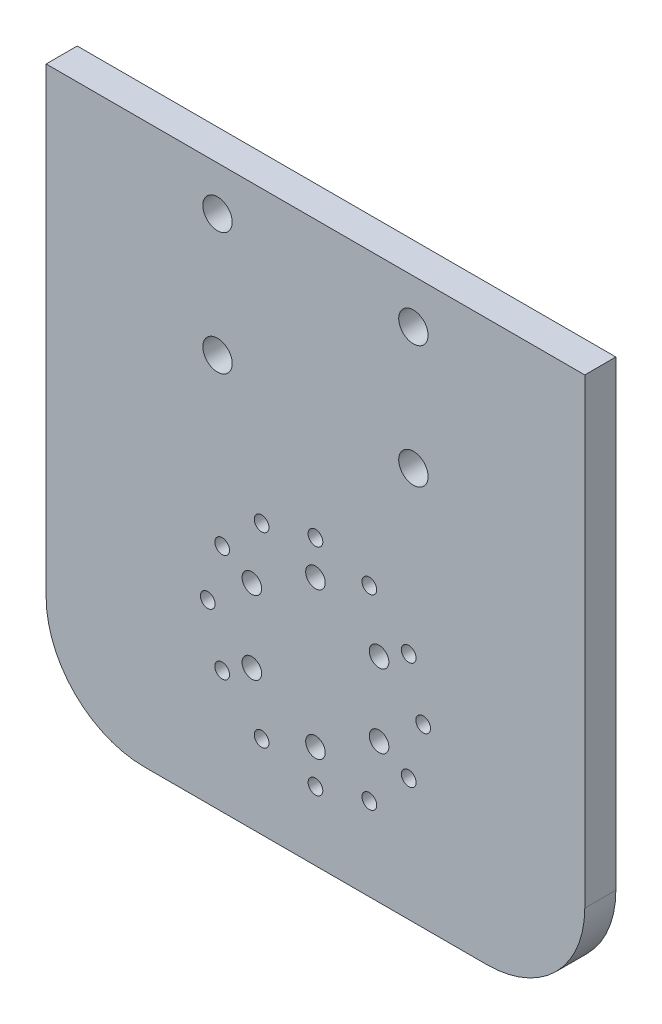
from build123d import *

# Parameters (mm, degrees)
SKETCH1_W           = 114.3
SKETCH1_H           = 110
SKETCH1_R           = 2
SKETCH1_R_2         = 1.5
SKETCH1_R_3         = 3
BOSS_EXTRUDE1_DEPTH = 6.35
FILLET1_R           = 20


with BuildPart() as part:
    # Sketch1 → Boss-Extrude1 (new body)
    with BuildSketch(Plane(origin=(0, 0, 0), x_dir=(0, 1, 0), z_dir=(0, 0, 1))):
        with Locations((21.15, 0)):
            Rectangle(SKETCH1_W, SKETCH1_H)
        with Locations(Location((15, 0, 0), (0, 0, 270))):
            Circle(SKETCH1_R, mode=Mode.SUBTRACT)
        with Locations(Location((7.5, -12.990381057, 0), (0, 0, 270))):
            Circle(SKETCH1_R, mode=Mode.SUBTRACT)
        with Locations(Location((-7.5, -12.990381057, 0), (0, 0, 270))):
            Circle(SKETCH1_R, mode=Mode.SUBTRACT)
        with Locations(Location((-15, 0, 0), (0, 0, 270))):
            Circle(SKETCH1_R, mode=Mode.SUBTRACT)
        with Locations(Location((-7.5, 12.990381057, 0), (0, 0, 270))):
            Circle(SKETCH1_R, mode=Mode.SUBTRACT)
        with Locations(Location((7.5, 12.990381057, 0), (0, 0, 270))):
            Circle(SKETCH1_R, mode=Mode.SUBTRACT)
        with Locations(Location((22, 0, 0), (0, 0, 270))):
            Circle(SKETCH1_R_2, mode=Mode.SUBTRACT)
        with Locations(Location((19.052558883, -11, 0), (0, 0, 270))):
            Circle(SKETCH1_R_2, mode=Mode.SUBTRACT)
        with Locations(Location((11, -19.052558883, 0), (0, 0, 270))):
            Circle(SKETCH1_R_2, mode=Mode.SUBTRACT)
        with Locations(Location((0, -22, 0), (0, 0, 270))):
            Circle(SKETCH1_R_2, mode=Mode.SUBTRACT)
        with Locations(Location((-11, -19.052558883, 0), (0, 0, 270))):
            Circle(SKETCH1_R_2, mode=Mode.SUBTRACT)
        with Locations(Location((-19.052558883, -11, 0), (0, 0, 270))):
            Circle(SKETCH1_R_2, mode=Mode.SUBTRACT)
        with Locations(Location((-22, 0, 0), (0, 0, 270))):
            Circle(SKETCH1_R_2, mode=Mode.SUBTRACT)
        with Locations(Location((-19.052558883, 11, 0), (0, 0, 270))):
            Circle(SKETCH1_R_2, mode=Mode.SUBTRACT)
        with Locations(Location((-11, 19.052558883, 0), (0, 0, 270))):
            Circle(SKETCH1_R_2, mode=Mode.SUBTRACT)
        with Locations(Location((0, 22, 0), (0, 0, 270))):
            Circle(SKETCH1_R_2, mode=Mode.SUBTRACT)
        with Locations(Location((11, 19.052558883, 0), (0, 0, 270))):
            Circle(SKETCH1_R_2, mode=Mode.SUBTRACT)
        with Locations(Location((19.052558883, 11, 0), (0, 0, 270))):
            Circle(SKETCH1_R_2, mode=Mode.SUBTRACT)
        with Locations(Location((69.3, 20, 0), (0, 0, 270))):
            Circle(SKETCH1_R_3, mode=Mode.SUBTRACT)
        with Locations(Location((44.3, 20, 0), (0, 0, 270))):
            Circle(SKETCH1_R_3, mode=Mode.SUBTRACT)
        with Locations(Location((44.3, -20, 0), (0, 0, 270))):
            Circle(SKETCH1_R_3, mode=Mode.SUBTRACT)
        with Locations(Location((69.3, -20, 0), (0, 0, 270))):
            Circle(SKETCH1_R_3, mode=Mode.SUBTRACT)
    extrude(amount=BOSS_EXTRUDE1_DEPTH)

    # Fillet1
    fillet1_edges = [part.edges().sort_by_distance(p)[0] for p in [
        (-55, -36, 3.175),
        (55, -36, 3.175),
    ]]
    fillet(fillet1_edges, radius=FILLET1_R)


solid = part.part
